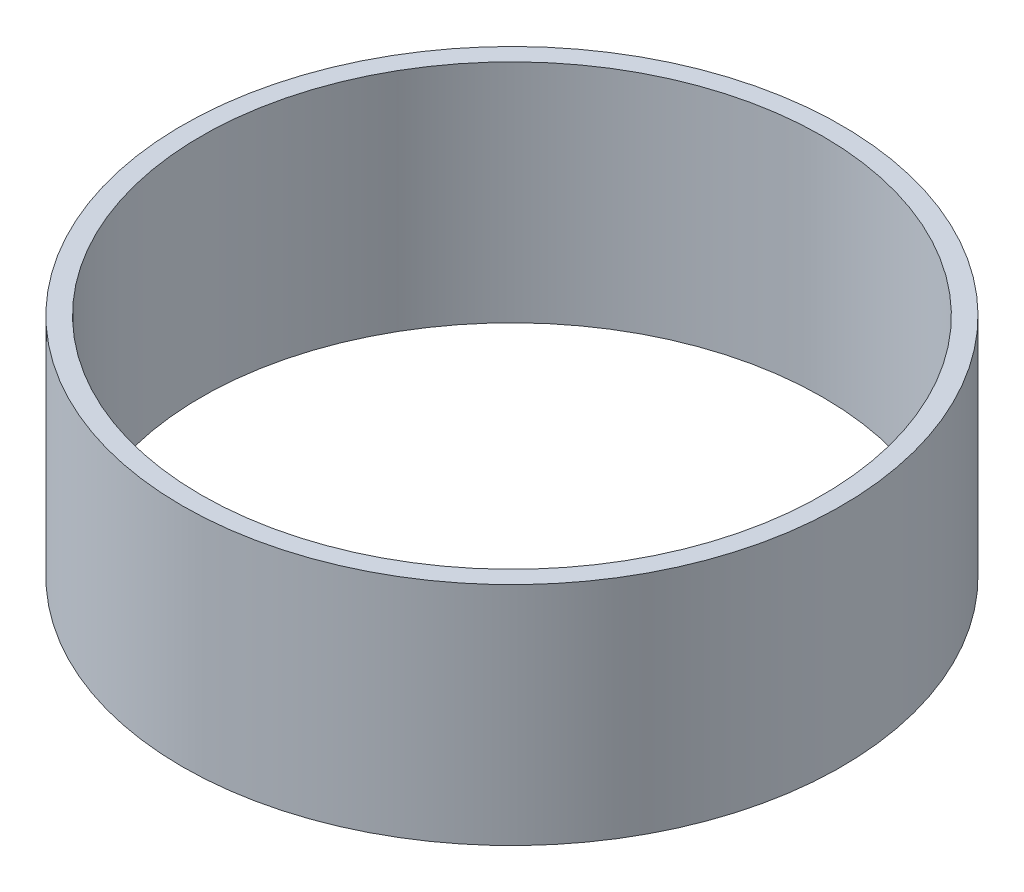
ISO-10303-21;
HEADER;
FILE_DESCRIPTION(('STEP AP214'),'2;1');
FILE_NAME('part.step','',(''),(''),'','','');
FILE_SCHEMA(('AUTOMOTIVE_DESIGN { 1 0 10303 214 1 1 1 1 }'));
ENDSEC;
DATA;
#1=APPLICATION_CONTEXT('core data for automotive mechanical design processes');
#2=APPLICATION_PROTOCOL_DEFINITION('international standard','automotive_design',2000,#1);
#3=PRODUCT_CONTEXT('',#1,'mechanical');
#4=PRODUCT('Part','Part','',(#3));
#5=PRODUCT_RELATED_PRODUCT_CATEGORY('part','',(#4));
#6=PRODUCT_DEFINITION_FORMATION('','',#4);
#7=PRODUCT_DEFINITION_CONTEXT('part definition',#1,'design');
#8=PRODUCT_DEFINITION('design','',#6,#7);
#9=PRODUCT_DEFINITION_SHAPE('','',#8);
#10=(LENGTH_UNIT() NAMED_UNIT(*) SI_UNIT(.MILLI.,.METRE.));
#11=(NAMED_UNIT(*) PLANE_ANGLE_UNIT() SI_UNIT($,.RADIAN.));
#12=(NAMED_UNIT(*) SI_UNIT($,.STERADIAN.) SOLID_ANGLE_UNIT());
#13=UNCERTAINTY_MEASURE_WITH_UNIT(LENGTH_MEASURE(1.E-05),#10,'distance_accuracy_value','');
#14=(GEOMETRIC_REPRESENTATION_CONTEXT(3) GLOBAL_UNCERTAINTY_ASSIGNED_CONTEXT((#13)) GLOBAL_UNIT_ASSIGNED_CONTEXT((#10,
#11,#12)) REPRESENTATION_CONTEXT('',''));
#15=CARTESIAN_POINT('',(0.,0.,0.));
#16=DIRECTION('',(0.,0.,1.));
#17=DIRECTION('',(1.,0.,0.));
#18=AXIS2_PLACEMENT_3D('',#15,#16,#17);
#19=CARTESIAN_POINT('',(0.,12.,0.));
#20=DIRECTION('',(0.,1.,0.));
#21=DIRECTION('',(0.,0.,1.));
#22=AXIS2_PLACEMENT_3D('',#19,#20,#21);
#23=PLANE('',#22);
#24=CARTESIAN_POINT('',(0.,12.,0.));
#25=DIRECTION('',(0.,1.,0.));
#26=DIRECTION('',(0.,0.,1.));
#27=AXIS2_PLACEMENT_3D('',#24,#25,#26);
#28=CIRCLE('',#27,17.5);
#29=CARTESIAN_POINT('',(0.,12.,17.5));
#30=VERTEX_POINT('',#29);
#31=EDGE_CURVE('E10',#30,#30,#28,.T.);
#32=ORIENTED_EDGE('',*,*,#31,.T.);
#33=EDGE_LOOP('',(#32));
#34=FACE_BOUND('',#33,.T.);
#35=CARTESIAN_POINT('',(0.,12.,0.));
#36=DIRECTION('',(0.,1.,0.));
#37=DIRECTION('',(0.,0.,1.));
#38=AXIS2_PLACEMENT_3D('',#35,#36,#37);
#39=CIRCLE('',#38,16.5);
#40=CARTESIAN_POINT('',(0.,12.,16.5));
#41=VERTEX_POINT('',#40);
#42=EDGE_CURVE('E41',#41,#41,#39,.T.);
#43=ORIENTED_EDGE('',*,*,#42,.F.);
#44=EDGE_LOOP('',(#43));
#45=FACE_BOUND('',#44,.T.);
#46=ADVANCED_FACE('F30',(#34,#45),#23,.T.);
#47=CARTESIAN_POINT('',(0.,0.,0.));
#48=DIRECTION('',(0.,1.,0.));
#49=DIRECTION('',(0.,0.,1.));
#50=AXIS2_PLACEMENT_3D('',#47,#48,#49);
#51=PLANE('',#50);
#52=CARTESIAN_POINT('',(0.,0.,0.));
#53=DIRECTION('',(0.,1.,0.));
#54=DIRECTION('',(0.,0.,1.));
#55=AXIS2_PLACEMENT_3D('',#52,#53,#54);
#56=CIRCLE('',#55,17.5);
#57=CARTESIAN_POINT('',(0.,0.,17.5));
#58=VERTEX_POINT('',#57);
#59=EDGE_CURVE('E34',#58,#58,#56,.T.);
#60=ORIENTED_EDGE('',*,*,#59,.F.);
#61=EDGE_LOOP('',(#60));
#62=FACE_BOUND('',#61,.T.);
#63=CARTESIAN_POINT('',(0.,0.,0.));
#64=DIRECTION('',(0.,1.,0.));
#65=DIRECTION('',(0.,0.,1.));
#66=AXIS2_PLACEMENT_3D('',#63,#64,#65);
#67=CIRCLE('',#66,16.5);
#68=CARTESIAN_POINT('',(0.,0.,16.5));
#69=VERTEX_POINT('',#68);
#70=EDGE_CURVE('E43',#69,#69,#67,.T.);
#71=ORIENTED_EDGE('',*,*,#70,.T.);
#72=EDGE_LOOP('',(#71));
#73=FACE_BOUND('',#72,.T.);
#74=ADVANCED_FACE('F53',(#62,#73),#51,.F.);
#75=CARTESIAN_POINT('',(0.,12.,0.));
#76=DIRECTION('',(0.,-1.,0.));
#77=DIRECTION('',(0.,0.,-1.));
#78=AXIS2_PLACEMENT_3D('',#75,#76,#77);
#79=CYLINDRICAL_SURFACE('',#78,17.5);
#80=ORIENTED_EDGE('',*,*,#31,.F.);
#81=EDGE_LOOP('',(#80));
#82=FACE_BOUND('',#81,.T.);
#83=ORIENTED_EDGE('',*,*,#59,.T.);
#84=EDGE_LOOP('',(#83));
#85=FACE_BOUND('',#84,.T.);
#86=ADVANCED_FACE('F32',(#82,#85),#79,.T.);
#87=CARTESIAN_POINT('',(0.,12.,0.));
#88=DIRECTION('',(0.,-1.,0.));
#89=DIRECTION('',(0.,0.,-1.));
#90=AXIS2_PLACEMENT_3D('',#87,#88,#89);
#91=CYLINDRICAL_SURFACE('',#90,16.5);
#92=ORIENTED_EDGE('',*,*,#42,.T.);
#93=EDGE_LOOP('',(#92));
#94=FACE_BOUND('',#93,.T.);
#95=ORIENTED_EDGE('',*,*,#70,.F.);
#96=EDGE_LOOP('',(#95));
#97=FACE_BOUND('',#96,.T.);
#98=ADVANCED_FACE('F49',(#94,#97),#91,.F.);
#99=CLOSED_SHELL('',(#46,#74,#86,#98));
#100=MANIFOLD_SOLID_BREP('B2',#99);
#101=ADVANCED_BREP_SHAPE_REPRESENTATION('',(#18,#100),#14);
#102=SHAPE_DEFINITION_REPRESENTATION(#9,#101);
ENDSEC;
END-ISO-10303-21;
